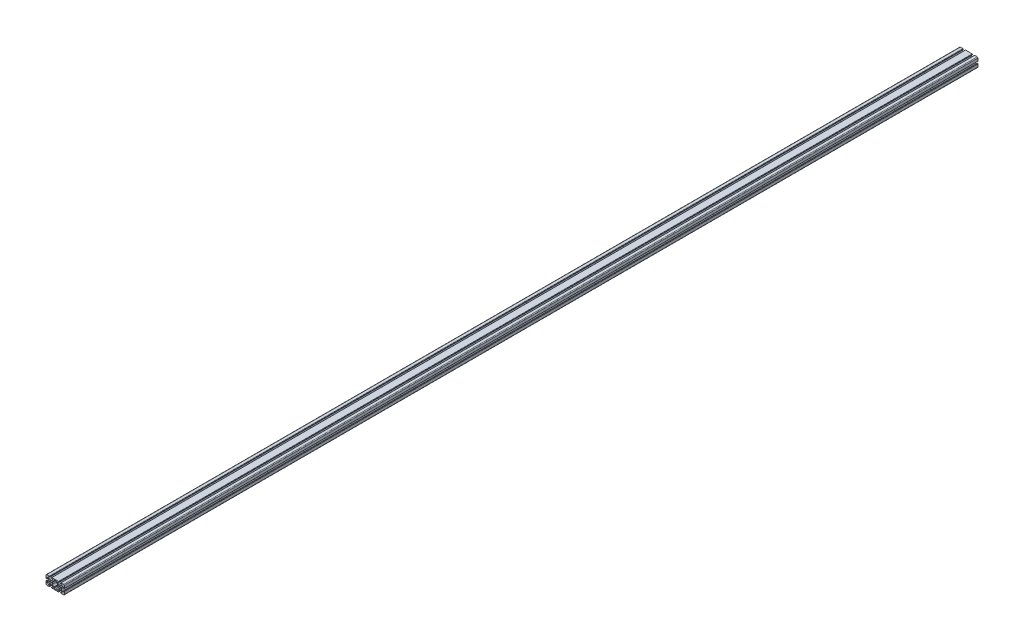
from build123d import *

# Parameters (mm, degrees)
SKETCH1_R      = 3.4
EXTRUDE1_DEPTH = 4000


with BuildPart() as part:
    # Sketch1 → Extrude1 (new body)
    with BuildSketch(Plane.XY):
        with BuildLine():
            Line((-14.371895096, 20), (14.371895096, 20))
            ThreePointArc((14.371895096, 20), (15.50899084, 19.51254943), (15.94, 18.352883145))
            Line((15.94, 18.352883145), (15.94, 17.172883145))
            ThreePointArc((15.94, 17.172883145), (15.453758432, 16.112250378), (14.37, 15.68))
            Line((14.37, 15.68), (11.285, 15.68))
            ThreePointArc((11.285, 15.68), (10.174842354, 15.220157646), (9.715, 14.11))
            Line((9.715, 14.11), (9.715, 13.654503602))
            ThreePointArc((9.715, 13.654503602), (9.772851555, 13.363664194), (9.937598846, 13.117102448))
            Line((9.937598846, 13.117102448), (14.091872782, 8.962828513))
            ThreePointArc((14.091872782, 8.962828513), (15.647416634, 8.002049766), (17.450629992, 7.7))
            Line((17.450629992, 7.7), (22.549370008, 7.7))
            ThreePointArc((22.549370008, 7.7), (24.352583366, 8.002049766), (25.908127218, 8.962828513))
            Line((25.908127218, 8.962828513), (30.062401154, 13.117102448))
            ThreePointArc((30.062401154, 13.117102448), (30.227148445, 13.363664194), (30.285, 13.654503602))
            Line((30.285, 13.654503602), (30.285, 14.11))
            ThreePointArc((30.285, 14.11), (29.825157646, 15.220157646), (28.715, 15.68))
            Line((28.715, 15.68), (25.63, 15.68))
            ThreePointArc((25.63, 15.68), (24.519842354, 16.139842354), (24.06, 17.25))
            Line((24.06, 17.25), (24.06, 18.431164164))
            ThreePointArc((24.06, 18.431164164), (24.498672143, 19.519739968), (25.569550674, 20))
            Line((25.569550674, 20), (33, 20))
            Line((33, 20), (36.83, 20))
            ThreePointArc((36.83, 20), (39.067780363, 19.075288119), (40, 16.840624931))
            Line((40, 16.840624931), (40, 13.010624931))
            Line((40, 13.010624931), (40, 5.582508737))
            ThreePointArc((40, 5.582508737), (39.486387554, 4.464397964), (38.324306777, 4.06))
            Line((38.324306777, 4.06), (37.144306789, 4.06))
            ThreePointArc((37.144306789, 4.06), (36.103082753, 4.554299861), (35.68, 5.626438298))
            Line((35.68, 5.626438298), (35.68, 8.711438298))
            ThreePointArc((35.68, 8.711438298), (35.220157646, 9.821595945), (34.11, 10.281438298))
            Line((34.11, 10.281438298), (33.650941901, 10.281438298))
            ThreePointArc((33.650941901, 10.281438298), (33.360102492, 10.223586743), (33.113540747, 10.058839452))
            Line((33.113540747, 10.058839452), (29.01112516, 5.956423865))
            ThreePointArc((29.01112516, 5.956423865), (28.027864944, 4.392105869), (27.715866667, 2.570966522))
            Line((27.715866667, 2.570966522), (27.715866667, -2.502014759))
            ThreePointArc((27.715866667, -2.502014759), (27.988460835, -4.298258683), (28.915473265, -5.86077197))
            Line((28.915473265, -5.86077197), (33.171894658, -10.117193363))
            ThreePointArc((33.171894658, -10.117193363), (33.418456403, -10.281940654), (33.709295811, -10.339792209))
            Line((33.709295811, -10.339792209), (34.110956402, -10.339792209))
            ThreePointArc((34.110956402, -10.339792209), (35.240319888, -9.860405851), (35.68, -8.714999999))
            Line((35.68, -8.714999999), (35.68, -5.629999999))
            ThreePointArc((35.68, -5.629999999), (36.13984232, -4.519842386), (37.249999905, -4.06))
            Line((37.249999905, -4.06), (38.43, -4.06))
            ThreePointArc((38.43, -4.06), (39.519320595, -4.498268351), (40, -5.569550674))
            Line((40, -5.569550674), (40, -13))
            Line((40, -13), (40, -16.83))
            ThreePointArc((40, -16.83), (39.153330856, -18.99480488), (37.057427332, -20))
            Line((37.057427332, -20), (33.227427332, -20))
            Line((33.227427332, -20), (25.796978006, -20))
            ThreePointArc((25.796978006, -20), (24.580537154, -19.606606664), (24.06, -18.438904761))
            Line((24.06, -18.438904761), (24.06, -17.25))
            ThreePointArc((24.06, -17.25), (24.519842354, -16.139842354), (25.63, -15.68))
            Line((25.63, -15.68), (28.715, -15.68))
            ThreePointArc((28.715, -15.68), (29.825157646, -15.220157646), (30.285, -14.11))
            Line((30.285, -14.11), (30.285, -13.654503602))
            ThreePointArc((30.285, -13.654503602), (30.227148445, -13.363664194), (30.062401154, -13.117102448))
            Line((30.062401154, -13.117102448), (26.309520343, -9.364221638))
            ThreePointArc((26.309520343, -9.364221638), (24.979669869, -8.257223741), (23.341546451, -7.7))
            Line((23.341546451, -7.7), (16.658453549, -7.7))
            ThreePointArc((16.658453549, -7.7), (15.020330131, -8.257223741), (13.690479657, -9.364221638))
            Line((13.690479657, -9.364221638), (9.937598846, -13.117102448))
            ThreePointArc((9.937598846, -13.117102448), (9.772851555, -13.363664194), (9.715, -13.654503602))
            Line((9.715, -13.654503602), (9.715, -14.11))
            ThreePointArc((9.715, -14.11), (10.174842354, -15.220157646), (11.285, -15.68))
            Line((11.285, -15.68), (14.37, -15.68))
            ThreePointArc((14.37, -15.68), (15.480157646, -16.139842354), (15.94, -17.25))
            Line((15.94, -17.25), (15.94, -18.43))
            ThreePointArc((15.94, -18.43), (15.480157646, -19.540157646), (14.37, -20))
            Line((14.37, -20), (5.99100603, -20))
            Line((5.99100603, -20), (-1.780052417, -20))
            Line((-1.780052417, -20), (-5.99100603, -20))
            Line((-5.99100603, -20), (-14.37, -20))
            ThreePointArc((-14.37, -20), (-15.480157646, -19.540157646), (-15.94, -18.43))
            Line((-15.94, -18.43), (-15.94, -17.25))
            ThreePointArc((-15.94, -17.25), (-15.480157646, -16.139842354), (-14.37, -15.68))
            Line((-14.37, -15.68), (-11.285, -15.68))
            ThreePointArc((-11.285, -15.68), (-10.174842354, -15.220157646), (-9.715, -14.11))
            Line((-9.715, -14.11), (-9.715, -13.654503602))
            ThreePointArc((-9.715, -13.654503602), (-9.772851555, -13.363664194), (-9.937598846, -13.117102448))
            Line((-9.937598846, -13.117102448), (-13.690479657, -9.364221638))
            ThreePointArc((-13.690479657, -9.364221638), (-15.020330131, -8.257223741), (-16.658453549, -7.7))
            Line((-16.658453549, -7.7), (-23.341546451, -7.7))
            ThreePointArc((-23.341546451, -7.7), (-24.979669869, -8.257223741), (-26.309520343, -9.364221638))
            Line((-26.309520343, -9.364221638), (-30.062401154, -13.117102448))
            ThreePointArc((-30.062401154, -13.117102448), (-30.227148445, -13.363664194), (-30.285, -13.654503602))
            Line((-30.285, -13.654503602), (-30.285, -14.11))
            ThreePointArc((-30.285, -14.11), (-29.825157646, -15.220157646), (-28.715, -15.68))
            Line((-28.715, -15.68), (-25.63, -15.68))
            ThreePointArc((-25.63, -15.68), (-24.519842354, -16.139842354), (-24.06, -17.25))
            Line((-24.06, -17.25), (-24.06, -18.438904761))
            ThreePointArc((-24.06, -18.438904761), (-24.580537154, -19.606606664), (-25.796978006, -20))
            Line((-25.796978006, -20), (-33.227427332, -20))
            Line((-33.227427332, -20), (-37.057427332, -20))
            ThreePointArc((-37.057427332, -20), (-39.153330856, -18.99480488), (-40, -16.83))
            Line((-40, -16.83), (-40, -13))
            Line((-40, -13), (-40, -5.569550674))
            ThreePointArc((-40, -5.569550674), (-39.519320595, -4.498268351), (-38.43, -4.06))
            Line((-38.43, -4.06), (-37.249999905, -4.06))
            ThreePointArc((-37.249999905, -4.06), (-36.13984232, -4.519842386), (-35.68, -5.629999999))
            Line((-35.68, -5.629999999), (-35.68, -8.714999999))
            ThreePointArc((-35.68, -8.714999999), (-35.240319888, -9.860405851), (-34.110956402, -10.339792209))
            Line((-34.110956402, -10.339792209), (-33.709295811, -10.339792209))
            ThreePointArc((-33.709295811, -10.339792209), (-33.418456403, -10.281940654), (-33.171894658, -10.117193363))
            Line((-33.171894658, -10.117193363), (-28.915473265, -5.86077197))
            ThreePointArc((-28.915473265, -5.86077197), (-27.988460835, -4.298258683), (-27.715866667, -2.502014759))
            Line((-27.715866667, -2.502014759), (-27.715866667, 2.570966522))
            ThreePointArc((-27.715866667, 2.570966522), (-28.027864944, 4.392105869), (-29.01112516, 5.956423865))
            Line((-29.01112516, 5.956423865), (-33.113540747, 10.058839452))
            ThreePointArc((-33.113540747, 10.058839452), (-33.360102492, 10.223586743), (-33.650941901, 10.281438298))
            Line((-33.650941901, 10.281438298), (-34.11, 10.281438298))
            ThreePointArc((-34.11, 10.281438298), (-35.220157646, 9.821595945), (-35.68, 8.711438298))
            Line((-35.68, 8.711438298), (-35.68, 5.626438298))
            ThreePointArc((-35.68, 5.626438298), (-36.103082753, 4.554299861), (-37.144306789, 4.06))
            Line((-37.144306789, 4.06), (-38.324306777, 4.06))
            ThreePointArc((-38.324306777, 4.06), (-39.486387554, 4.464397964), (-40, 5.582508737))
            Line((-40, 5.582508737), (-40, 13.010624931))
            Line((-40, 13.010624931), (-40, 16.840624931))
            ThreePointArc((-40, 16.840624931), (-39.067780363, 19.075288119), (-36.83, 20))
            Line((-36.83, 20), (-33, 20))
            Line((-33, 20), (-25.569550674, 20))
            ThreePointArc((-25.569550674, 20), (-24.498672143, 19.519739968), (-24.06, 18.431164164))
            Line((-24.06, 18.431164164), (-24.06, 17.25))
            ThreePointArc((-24.06, 17.25), (-24.519842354, 16.139842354), (-25.63, 15.68))
            Line((-25.63, 15.68), (-28.715, 15.68))
            ThreePointArc((-28.715, 15.68), (-29.825157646, 15.220157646), (-30.285, 14.11))
            Line((-30.285, 14.11), (-30.285, 13.654503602))
            ThreePointArc((-30.285, 13.654503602), (-30.227148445, 13.363664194), (-30.062401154, 13.117102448))
            Line((-30.062401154, 13.117102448), (-25.908127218, 8.962828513))
            ThreePointArc((-25.908127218, 8.962828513), (-24.352583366, 8.002049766), (-22.549370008, 7.7))
            Line((-22.549370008, 7.7), (-17.450629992, 7.7))
            ThreePointArc((-17.450629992, 7.7), (-15.647416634, 8.002049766), (-14.091872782, 8.962828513))
            Line((-14.091872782, 8.962828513), (-9.937598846, 13.117102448))
            ThreePointArc((-9.937598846, 13.117102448), (-9.772851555, 13.363664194), (-9.715, 13.654503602))
            Line((-9.715, 13.654503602), (-9.715, 14.11))
            ThreePointArc((-9.715, 14.11), (-10.174842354, 15.220157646), (-11.285, 15.68))
            Line((-11.285, 15.68), (-14.37, 15.68))
            ThreePointArc((-14.37, 15.68), (-15.453758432, 16.112250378), (-15.94, 17.172883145))
            Line((-15.94, 17.172883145), (-15.94, 18.352883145))
            ThreePointArc((-15.94, 18.352883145), (-15.50899084, 19.51254943), (-14.371895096, 20))
        make_face()
        with Locations((-20, 0)):
            Circle(SKETCH1_R, mode=Mode.SUBTRACT)
        with Locations(Location((20, 0, 0), (0, 0, 180))):
            Circle(SKETCH1_R, mode=Mode.SUBTRACT)
        with BuildLine():
            Line((4.071751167, 15.68), (-4.071751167, 15.68))
            ThreePointArc((-4.071751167, 15.68), (-4.969776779, 15.308025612), (-5.341751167, 14.41))
            Line((-5.341751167, 14.41), (-5.341751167, 12.129598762))
            ThreePointArc((-5.341751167, 12.129598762), (-5.438424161, 11.643590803), (-5.713725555, 11.23157315))
            Line((-5.713725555, 11.23157315), (-10.598777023, 6.346521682))
            ThreePointArc((-10.598777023, 6.346521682), (-11.737774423, 4.964558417), (-12.284133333, 3.259087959))
            Line((-12.284133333, 3.259087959), (-12.284133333, -2.724972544))
            ThreePointArc((-12.284133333, -2.724972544), (-12.005210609, -4.328708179), (-11.201199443, -5.744099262))
            Line((-11.201199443, -5.744099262), (-5.713725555, -11.23157315))
            ThreePointArc((-5.713725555, -11.23157315), (-5.438424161, -11.643590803), (-5.341751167, -12.129598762))
            Line((-5.341751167, -12.129598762), (-5.341751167, -14.41))
            ThreePointArc((-5.341751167, -14.41), (-4.969776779, -15.308025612), (-4.071751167, -15.68))
            Line((-4.071751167, -15.68), (4.071751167, -15.68))
            ThreePointArc((4.071751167, -15.68), (4.969776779, -15.308025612), (5.341751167, -14.41))
            Line((5.341751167, -14.41), (5.341751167, -12.129598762))
            ThreePointArc((5.341751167, -12.129598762), (5.438424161, -11.643590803), (5.713725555, -11.23157315))
            Line((5.713725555, -11.23157315), (11.201199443, -5.744099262))
            ThreePointArc((11.201199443, -5.744099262), (12.005210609, -4.328708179), (12.284133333, -2.724972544))
            Line((12.284133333, -2.724972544), (12.284133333, 3.259087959))
            ThreePointArc((12.284133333, 3.259087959), (11.737774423, 4.964558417), (10.598777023, 6.346521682))
            Line((10.598777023, 6.346521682), (5.713725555, 11.23157315))
            ThreePointArc((5.713725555, 11.23157315), (5.438424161, 11.643590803), (5.341751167, 12.129598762))
            Line((5.341751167, 12.129598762), (5.341751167, 14.41))
            ThreePointArc((5.341751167, 14.41), (4.969776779, 15.308025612), (4.071751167, 15.68))
        make_face(mode=Mode.SUBTRACT)
    extrude(amount=-EXTRUDE1_DEPTH)


solid = part.part
